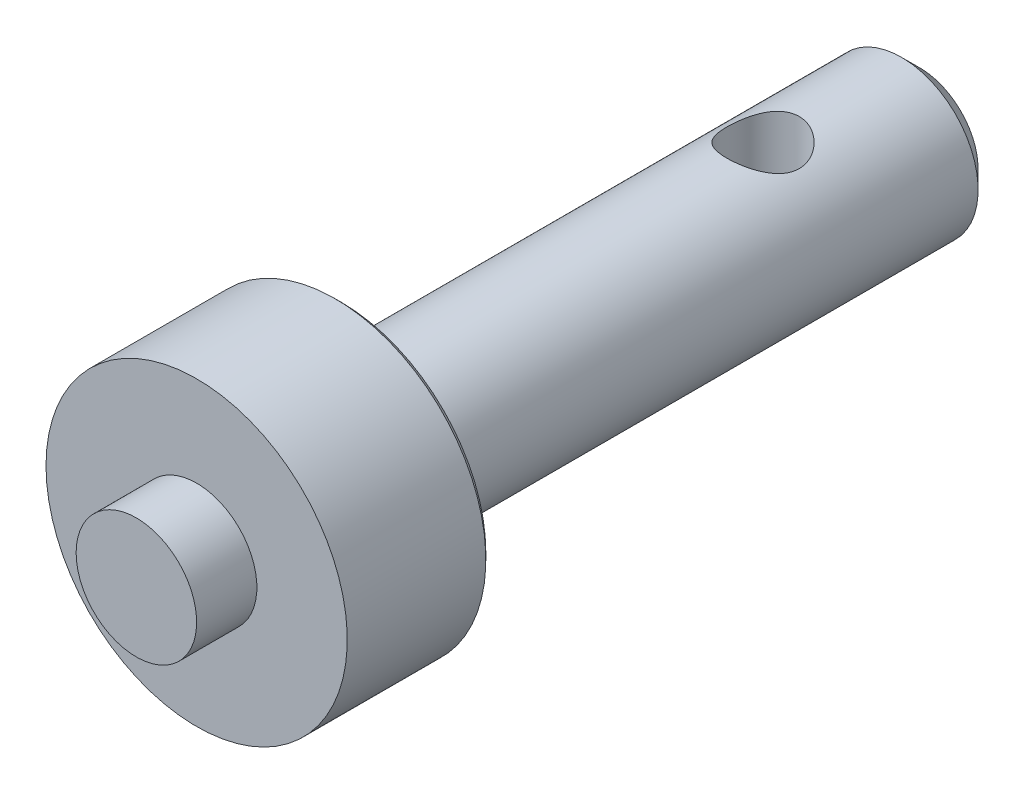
ISO-10303-21;
HEADER;
FILE_DESCRIPTION(('STEP AP214'),'2;1');
FILE_NAME('part.step','',(''),(''),'','','');
FILE_SCHEMA(('AUTOMOTIVE_DESIGN { 1 0 10303 214 1 1 1 1 }'));
ENDSEC;
DATA;
#1=APPLICATION_CONTEXT('core data for automotive mechanical design processes');
#2=APPLICATION_PROTOCOL_DEFINITION('international standard','automotive_design',2000,#1);
#3=PRODUCT_CONTEXT('',#1,'mechanical');
#4=PRODUCT('Part','Part','',(#3));
#5=PRODUCT_RELATED_PRODUCT_CATEGORY('part','',(#4));
#6=PRODUCT_DEFINITION_FORMATION('','',#4);
#7=PRODUCT_DEFINITION_CONTEXT('part definition',#1,'design');
#8=PRODUCT_DEFINITION('design','',#6,#7);
#9=PRODUCT_DEFINITION_SHAPE('','',#8);
#10=(LENGTH_UNIT() NAMED_UNIT(*) SI_UNIT(.MILLI.,.METRE.));
#11=(NAMED_UNIT(*) PLANE_ANGLE_UNIT() SI_UNIT($,.RADIAN.));
#12=(NAMED_UNIT(*) SI_UNIT($,.STERADIAN.) SOLID_ANGLE_UNIT());
#13=UNCERTAINTY_MEASURE_WITH_UNIT(LENGTH_MEASURE(1.E-05),#10,'distance_accuracy_value','');
#14=(GEOMETRIC_REPRESENTATION_CONTEXT(3) GLOBAL_UNCERTAINTY_ASSIGNED_CONTEXT((#13)) GLOBAL_UNIT_ASSIGNED_CONTEXT((#10,
#11,#12)) REPRESENTATION_CONTEXT('',''));
#15=CARTESIAN_POINT('',(0.,0.,0.));
#16=DIRECTION('',(0.,0.,1.));
#17=DIRECTION('',(1.,0.,0.));
#18=AXIS2_PLACEMENT_3D('',#15,#16,#17);
#19=CARTESIAN_POINT('',(0.,0.,0.));
#20=DIRECTION('',(0.,0.,1.));
#21=DIRECTION('',(1.,0.,0.));
#22=AXIS2_PLACEMENT_3D('',#19,#20,#21);
#23=PLANE('',#22);
#24=CARTESIAN_POINT('',(0.,0.,0.));
#25=DIRECTION('',(0.,0.,-1.));
#26=DIRECTION('',(-1.,0.,0.));
#27=AXIS2_PLACEMENT_3D('',#24,#25,#26);
#28=CIRCLE('',#27,4.99999999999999);
#29=CARTESIAN_POINT('',(-4.99999999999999,0.,0.));
#30=VERTEX_POINT('',#29);
#31=EDGE_CURVE('E10',#30,#30,#28,.T.);
#32=ORIENTED_EDGE('',*,*,#31,.F.);
#33=EDGE_LOOP('',(#32));
#34=FACE_BOUND('',#33,.T.);
#35=ADVANCED_FACE('F29',(#34),#23,.T.);
#36=CARTESIAN_POINT('',(0.,0.,-65.));
#37=DIRECTION('',(0.,0.,-1.));
#38=DIRECTION('',(-1.,0.,0.));
#39=AXIS2_PLACEMENT_3D('',#36,#37,#38);
#40=CYLINDRICAL_SURFACE('',#39,4.99999999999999);
#41=ORIENTED_EDGE('',*,*,#31,.T.);
#42=EDGE_LOOP('',(#41));
#43=FACE_BOUND('',#42,.T.);
#44=CARTESIAN_POINT('',(0.,0.,-5.));
#45=DIRECTION('',(0.,0.,-1.));
#46=DIRECTION('',(-1.,0.,0.));
#47=AXIS2_PLACEMENT_3D('',#44,#45,#46);
#48=CIRCLE('',#47,4.99999999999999);
#49=CARTESIAN_POINT('',(-4.99999999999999,0.,-5.));
#50=VERTEX_POINT('',#49);
#51=EDGE_CURVE('E40',#50,#50,#48,.T.);
#52=ORIENTED_EDGE('',*,*,#51,.F.);
#53=EDGE_LOOP('',(#52));
#54=FACE_BOUND('',#53,.T.);
#55=ADVANCED_FACE('F76',(#43,#54),#40,.T.);
#56=CARTESIAN_POINT('',(0.,4.99999999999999,-5.));
#57=DIRECTION('',(0.,0.,1.));
#58=DIRECTION('',(1.,0.,0.));
#59=AXIS2_PLACEMENT_3D('',#56,#57,#58);
#60=PLANE('',#59);
#61=ORIENTED_EDGE('',*,*,#51,.T.);
#62=EDGE_LOOP('',(#61));
#63=FACE_BOUND('',#62,.T.);
#64=CARTESIAN_POINT('',(0.,0.,-5.));
#65=DIRECTION('',(0.,0.,-1.));
#66=DIRECTION('',(-1.,0.,0.));
#67=AXIS2_PLACEMENT_3D('',#64,#65,#66);
#68=CIRCLE('',#67,12.5);
#69=CARTESIAN_POINT('',(-12.5,0.,-5.));
#70=VERTEX_POINT('',#69);
#71=EDGE_CURVE('E45',#70,#70,#68,.T.);
#72=ORIENTED_EDGE('',*,*,#71,.F.);
#73=EDGE_LOOP('',(#72));
#74=FACE_BOUND('',#73,.T.);
#75=ADVANCED_FACE('F81',(#63,#74),#60,.T.);
#76=CARTESIAN_POINT('',(0.,0.,-65.));
#77=DIRECTION('',(0.,0.,-1.));
#78=DIRECTION('',(-1.,0.,0.));
#79=AXIS2_PLACEMENT_3D('',#76,#77,#78);
#80=CYLINDRICAL_SURFACE('',#79,12.5);
#81=ORIENTED_EDGE('',*,*,#71,.T.);
#82=EDGE_LOOP('',(#81));
#83=FACE_BOUND('',#82,.T.);
#84=CARTESIAN_POINT('',(0.,0.,-16.5));
#85=DIRECTION('',(0.,0.,-1.));
#86=DIRECTION('',(-1.,0.,0.));
#87=AXIS2_PLACEMENT_3D('',#84,#85,#86);
#88=CIRCLE('',#87,12.5);
#89=CARTESIAN_POINT('',(-12.5,0.,-16.5));
#90=VERTEX_POINT('',#89);
#91=EDGE_CURVE('E110',#90,#90,#88,.T.);
#92=ORIENTED_EDGE('',*,*,#91,.F.);
#93=EDGE_LOOP('',(#92));
#94=FACE_BOUND('',#93,.T.);
#95=ADVANCED_FACE('F85',(#83,#94),#80,.T.);
#96=CARTESIAN_POINT('',(0.,0.,-17.));
#97=DIRECTION('',(0.,0.,1.));
#98=DIRECTION('',(1.,0.,0.));
#99=AXIS2_PLACEMENT_3D('',#96,#97,#98);
#100=CONICAL_SURFACE('',#99,12.,0.78539816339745);
#101=ORIENTED_EDGE('',*,*,#91,.T.);
#102=EDGE_LOOP('',(#101));
#103=FACE_BOUND('',#102,.T.);
#104=CARTESIAN_POINT('',(0.,0.,-17.));
#105=DIRECTION('',(0.,0.,-1.));
#106=DIRECTION('',(-1.,0.,0.));
#107=AXIS2_PLACEMENT_3D('',#104,#105,#106);
#108=CIRCLE('',#107,12.);
#109=CARTESIAN_POINT('',(-12.,0.,-17.));
#110=VERTEX_POINT('',#109);
#111=EDGE_CURVE('E103',#110,#110,#108,.T.);
#112=ORIENTED_EDGE('',*,*,#111,.F.);
#113=EDGE_LOOP('',(#112));
#114=FACE_BOUND('',#113,.T.);
#115=ADVANCED_FACE('F92',(#103,#114),#100,.T.);
#116=CARTESIAN_POINT('',(0.,12.,-17.));
#117=DIRECTION('',(0.,0.,-1.));
#118=DIRECTION('',(-1.,0.,0.));
#119=AXIS2_PLACEMENT_3D('',#116,#117,#118);
#120=PLANE('',#119);
#121=ORIENTED_EDGE('',*,*,#111,.T.);
#122=EDGE_LOOP('',(#121));
#123=FACE_BOUND('',#122,.T.);
#124=CARTESIAN_POINT('',(0.,0.,-17.));
#125=DIRECTION('',(0.,0.,-1.));
#126=DIRECTION('',(-1.,0.,0.));
#127=AXIS2_PLACEMENT_3D('',#124,#125,#126);
#128=CIRCLE('',#127,6.34999999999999);
#129=CARTESIAN_POINT('',(-6.34999999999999,0.,-17.));
#130=VERTEX_POINT('',#129);
#131=EDGE_CURVE('E106',#130,#130,#128,.T.);
#132=ORIENTED_EDGE('',*,*,#131,.F.);
#133=EDGE_LOOP('',(#132));
#134=FACE_BOUND('',#133,.T.);
#135=ADVANCED_FACE('F71',(#123,#134),#120,.T.);
#136=CARTESIAN_POINT('',(0.,0.,-65.));
#137=DIRECTION('',(0.,0.,-1.));
#138=DIRECTION('',(-1.,0.,0.));
#139=AXIS2_PLACEMENT_3D('',#136,#137,#138);
#140=CYLINDRICAL_SURFACE('',#139,6.34999999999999);
#141=CARTESIAN_POINT('',(0.,-6.34999999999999,-49.));
#142=CARTESIAN_POINT('',(-0.158735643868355,-6.34999131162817,-49.0000104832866));
#143=CARTESIAN_POINT('',(-0.317696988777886,-6.34398210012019,-49.0126737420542));
#144=CARTESIAN_POINT('',(-0.630982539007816,-6.32053556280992,-49.0628003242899));
#145=CARTESIAN_POINT('',(-0.785295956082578,-6.30307351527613,-49.1003172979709));
#146=CARTESIAN_POINT('',(-1.08426902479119,-6.25856360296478,-49.1983909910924));
#147=CARTESIAN_POINT('',(-1.22896239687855,-6.23155157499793,-49.2588616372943));
#148=CARTESIAN_POINT('',(-1.50596538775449,-6.17047124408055,-49.4007104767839));
#149=CARTESIAN_POINT('',(-1.63827688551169,-6.1364040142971,-49.4820854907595));
#150=CARTESIAN_POINT('',(-1.89506470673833,-6.06218401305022,-49.6686289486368));
#151=CARTESIAN_POINT('',(-2.0186935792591,-6.02179791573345,-49.7748705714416));
#152=CARTESIAN_POINT('',(-2.24713450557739,-5.94033863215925,-50.0058035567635));
#153=CARTESIAN_POINT('',(-2.35193384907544,-5.8992650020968,-50.1305072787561));
#154=CARTESIAN_POINT('',(-2.54682621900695,-5.81791039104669,-50.4050648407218));
#155=CARTESIAN_POINT('',(-2.63545600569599,-5.77786853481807,-50.5560461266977));
#156=CARTESIAN_POINT('',(-2.74809115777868,-5.72470256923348,-50.7934763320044));
#157=CARTESIAN_POINT('',(-2.78225974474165,-5.70812542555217,-50.8744765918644));
#158=CARTESIAN_POINT('',(-2.84348823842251,-5.67787297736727,-51.0396280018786));
#159=CARTESIAN_POINT('',(-2.87055214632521,-5.66419604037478,-51.1237773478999));
#160=CARTESIAN_POINT('',(-2.9159220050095,-5.6409673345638,-51.2897986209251));
#161=CARTESIAN_POINT('',(-2.93463412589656,-5.63122717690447,-51.3715334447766));
#162=CARTESIAN_POINT('',(-2.96517735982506,-5.6152044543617,-51.5365762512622));
#163=CARTESIAN_POINT('',(-2.9770119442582,-5.60892014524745,-51.6198834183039));
#164=CARTESIAN_POINT('',(-2.99363646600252,-5.60006542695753,-51.7873623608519));
#165=CARTESIAN_POINT('',(-2.99842966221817,-5.59749329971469,-51.8715337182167));
#166=CARTESIAN_POINT('',(-3.00091788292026,-5.59615798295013,-52.0399844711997));
#167=CARTESIAN_POINT('',(-2.99861346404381,-5.59739449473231,-52.1242638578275));
#168=CARTESIAN_POINT('',(-2.98228707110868,-5.60612787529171,-52.3586473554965));
#169=CARTESIAN_POINT('',(-2.96044454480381,-5.61779971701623,-52.5081386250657));
#170=CARTESIAN_POINT('',(-2.89501216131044,-5.6517888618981,-52.80091706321));
#171=CARTESIAN_POINT('',(-2.85141651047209,-5.67410900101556,-52.9442025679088));
#172=CARTESIAN_POINT('',(-2.74288007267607,-5.72737541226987,-53.2246352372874));
#173=CARTESIAN_POINT('',(-2.67746822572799,-5.75850952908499,-53.3615633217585));
#174=CARTESIAN_POINT('',(-2.5275009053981,-5.82588930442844,-53.6231136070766));
#175=CARTESIAN_POINT('',(-2.44293700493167,-5.86213721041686,-53.7477303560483));
#176=CARTESIAN_POINT('',(-2.24603652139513,-5.94055944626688,-53.9957713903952));
#177=CARTESIAN_POINT('',(-2.13165370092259,-5.98294371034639,-54.1175105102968));
#178=CARTESIAN_POINT('',(-1.88382332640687,-6.06553935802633,-54.3407340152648));
#179=CARTESIAN_POINT('',(-1.75036848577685,-6.10574990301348,-54.4422106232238));
#180=CARTESIAN_POINT('',(-1.46180089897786,-6.1813162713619,-54.6255310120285));
#181=CARTESIAN_POINT('',(-1.30606552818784,-6.21643476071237,-54.7065002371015));
#182=CARTESIAN_POINT('',(-0.981099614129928,-6.27591792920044,-54.8404697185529));
#183=CARTESIAN_POINT('',(-0.811878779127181,-6.30029026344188,-54.8934898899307));
#184=CARTESIAN_POINT('',(-0.478650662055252,-6.33397698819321,-54.9660934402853));
#185=CARTESIAN_POINT('',(-0.315236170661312,-6.34430139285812,-54.9879260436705));
#186=CARTESIAN_POINT('',(0.0132401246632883,-6.35210748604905,-55.0044690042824));
#187=CARTESIAN_POINT('',(0.178301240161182,-6.34959433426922,-54.9991902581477));
#188=CARTESIAN_POINT('',(0.493581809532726,-6.33262500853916,-54.963082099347));
#189=CARTESIAN_POINT('',(0.644051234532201,-6.31898607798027,-54.9340006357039));
#190=CARTESIAN_POINT('',(0.937719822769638,-6.28212499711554,-54.8537450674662));
#191=CARTESIAN_POINT('',(1.08091814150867,-6.25890173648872,-54.8025684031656));
#192=CARTESIAN_POINT('',(1.36096532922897,-6.20413258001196,-54.6780544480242));
#193=CARTESIAN_POINT('',(1.49748886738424,-6.17235515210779,-54.6040908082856));
#194=CARTESIAN_POINT('',(1.75666682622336,-6.103656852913,-54.4367891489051));
#195=CARTESIAN_POINT('',(1.87931512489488,-6.06673372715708,-54.3434426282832));
#196=CARTESIAN_POINT('',(2.11888943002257,-5.98749695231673,-54.1303196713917));
#197=CARTESIAN_POINT('',(2.23431643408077,-5.94499681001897,-54.0089239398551));
#198=CARTESIAN_POINT('',(2.44375164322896,-5.86202140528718,-53.7481599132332));
#199=CARTESIAN_POINT('',(2.53774887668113,-5.82154718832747,-53.6087824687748));
#200=CARTESIAN_POINT('',(2.70463547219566,-5.74596844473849,-53.3096827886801));
#201=CARTESIAN_POINT('',(2.77667149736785,-5.71110126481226,-53.1494194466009));
#202=CARTESIAN_POINT('',(2.89199593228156,-5.65359008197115,-52.8168485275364));
#203=CARTESIAN_POINT('',(2.93531709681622,-5.63093215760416,-52.6445549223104));
#204=CARTESIAN_POINT('',(2.98833110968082,-5.60296296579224,-52.3097268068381));
#205=CARTESIAN_POINT('',(3.0007349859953,-5.59625585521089,-52.1477390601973));
#206=CARTESIAN_POINT('',(2.99919821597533,-5.5970815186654,-51.8239486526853));
#207=CARTESIAN_POINT('',(2.98526553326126,-5.60460998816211,-51.6621459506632));
#208=CARTESIAN_POINT('',(2.93391097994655,-5.63164218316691,-51.3562762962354));
#209=CARTESIAN_POINT('',(2.8983673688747,-5.65018584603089,-51.2117994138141));
#210=CARTESIAN_POINT('',(2.80694513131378,-5.69615317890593,-50.9309420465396));
#211=CARTESIAN_POINT('',(2.75106038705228,-5.72357952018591,-50.7945640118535));
#212=CARTESIAN_POINT('',(2.61632375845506,-5.78646860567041,-50.5237790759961));
#213=CARTESIAN_POINT('',(2.53618984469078,-5.8223450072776,-50.3901087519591));
#214=CARTESIAN_POINT('',(2.35675969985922,-5.89725587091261,-50.1372777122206));
#215=CARTESIAN_POINT('',(2.25745430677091,-5.93629183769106,-50.0181239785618));
#216=CARTESIAN_POINT('',(2.0303859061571,-6.01797799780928,-49.7848906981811));
#217=CARTESIAN_POINT('',(1.90073846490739,-6.06058247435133,-49.6726235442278));
#218=CARTESIAN_POINT('',(1.62298549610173,-6.14078504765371,-49.471105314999));
#219=CARTESIAN_POINT('',(1.47487109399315,-6.17838071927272,-49.3818653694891));
#220=CARTESIAN_POINT('',(1.24202481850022,-6.22785646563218,-49.2678129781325));
#221=CARTESIAN_POINT('',(1.16272476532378,-6.24318215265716,-49.2331244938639));
#222=CARTESIAN_POINT('',(1.00102034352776,-6.27113792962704,-49.1706082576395));
#223=CARTESIAN_POINT('',(0.918617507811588,-6.28376933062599,-49.1427771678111));
#224=CARTESIAN_POINT('',(0.751519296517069,-6.30593452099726,-49.0943552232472));
#225=CARTESIAN_POINT('',(0.666829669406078,-6.31547541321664,-49.073747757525));
#226=CARTESIAN_POINT('',(0.495718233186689,-6.33120329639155,-49.0399560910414));
#227=CARTESIAN_POINT('',(0.409297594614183,-6.33739247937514,-49.0267670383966));
#228=CARTESIAN_POINT('',(0.26890998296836,-6.34452974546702,-49.0115919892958));
#229=CARTESIAN_POINT('',(0.215242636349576,-6.34657804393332,-49.0072482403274));
#230=CARTESIAN_POINT('',(0.107725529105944,-6.34931466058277,-49.0014504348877));
#231=CARTESIAN_POINT('',(0.0538757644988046,-6.35000294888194,-48.9999964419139));
#232=CARTESIAN_POINT('',(0.,-6.34999999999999,-49.));
#233=B_SPLINE_CURVE_WITH_KNOTS('',3,(#141,#142,#143,#144,#145,#146,#147,#148,#149,#150,#151,
#152,#153,#154,#155,#156,#157,#158,#159,#160,#161,#162,#163,#164,#165,#166,#167,#168,#169,#170,
#171,#172,#173,#174,#175,#176,#177,#178,#179,#180,#181,#182,#183,#184,#185,#186,#187,#188,#189,
#190,#191,#192,#193,#194,#195,#196,#197,#198,#199,#200,#201,#202,#203,#204,#205,#206,#207,#208,
#209,#210,#211,#212,#213,#214,#215,#216,#217,#218,#219,#220,#221,#222,#223,#224,#225,#226,#227,
#228,#229,#230,#231,#232),.UNSPECIFIED.,.T.,.F.,(4,2,2,2,2,2,2,2,2,2,2,2,2,2,2,2,2,2,2,2,2,2,2,
2,2,2,2,2,2,2,2,2,2,2,2,2,2,2,2,2,2,2,2,2,2,4),(0.,0.475997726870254,0.953026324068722,
1.42828352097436,1.90346847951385,2.405132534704,2.90713396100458,3.44289983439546,
3.71097177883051,3.97889242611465,4.23178157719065,4.48454297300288,4.7371873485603,
4.98981191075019,5.44206841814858,5.89444544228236,6.35730164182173,6.82036189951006,
7.33510031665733,7.85003592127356,8.38419883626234,8.91798061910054,9.41089442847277,
9.9036101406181,10.3630820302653,10.8226071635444,11.2961009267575,11.7698027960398,
12.2859764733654,12.8024138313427,13.3369155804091,13.8708065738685,14.3559144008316,
14.8408755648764,15.2887410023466,15.7367412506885,16.2145869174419,16.6926615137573,
17.2203903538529,17.7483737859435,18.0117778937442,18.275053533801,18.5377197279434,
18.8002139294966,18.9617666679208,19.1233229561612),.UNSPECIFIED.);
#234=CARTESIAN_POINT('',(0.,-6.34999999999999,-49.));
#235=VERTEX_POINT('',#234);
#236=EDGE_CURVE('E32',#235,#235,#233,.T.);
#237=ORIENTED_EDGE('',*,*,#236,.F.);
#238=EDGE_LOOP('',(#237));
#239=FACE_BOUND('',#238,.T.);
#240=CARTESIAN_POINT('',(0.,6.34999999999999,-49.));
#241=CARTESIAN_POINT('',(0.158735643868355,6.34999131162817,-49.0000104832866));
#242=CARTESIAN_POINT('',(0.317696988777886,6.34398210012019,-49.0126737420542));
#243=CARTESIAN_POINT('',(0.630982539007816,6.32053556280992,-49.0628003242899));
#244=CARTESIAN_POINT('',(0.785295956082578,6.30307351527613,-49.1003172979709));
#245=CARTESIAN_POINT('',(1.08426902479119,6.25856360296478,-49.1983909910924));
#246=CARTESIAN_POINT('',(1.22896239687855,6.23155157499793,-49.2588616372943));
#247=CARTESIAN_POINT('',(1.50596538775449,6.17047124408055,-49.4007104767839));
#248=CARTESIAN_POINT('',(1.63827688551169,6.1364040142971,-49.4820854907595));
#249=CARTESIAN_POINT('',(1.89506470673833,6.06218401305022,-49.6686289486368));
#250=CARTESIAN_POINT('',(2.0186935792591,6.02179791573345,-49.7748705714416));
#251=CARTESIAN_POINT('',(2.24713450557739,5.94033863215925,-50.0058035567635));
#252=CARTESIAN_POINT('',(2.35193384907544,5.8992650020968,-50.1305072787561));
#253=CARTESIAN_POINT('',(2.54682621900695,5.81791039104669,-50.4050648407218));
#254=CARTESIAN_POINT('',(2.63545600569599,5.77786853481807,-50.5560461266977));
#255=CARTESIAN_POINT('',(2.74809115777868,5.72470256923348,-50.7934763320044));
#256=CARTESIAN_POINT('',(2.78225974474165,5.70812542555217,-50.8744765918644));
#257=CARTESIAN_POINT('',(2.84348823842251,5.67787297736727,-51.0396280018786));
#258=CARTESIAN_POINT('',(2.87055214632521,5.66419604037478,-51.1237773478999));
#259=CARTESIAN_POINT('',(2.9159220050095,5.6409673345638,-51.2897986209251));
#260=CARTESIAN_POINT('',(2.93463412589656,5.63122717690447,-51.3715334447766));
#261=CARTESIAN_POINT('',(2.96517735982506,5.6152044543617,-51.5365762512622));
#262=CARTESIAN_POINT('',(2.9770119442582,5.60892014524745,-51.6198834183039));
#263=CARTESIAN_POINT('',(2.99363646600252,5.60006542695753,-51.7873623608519));
#264=CARTESIAN_POINT('',(2.99842966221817,5.59749329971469,-51.8715337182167));
#265=CARTESIAN_POINT('',(3.00091788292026,5.59615798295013,-52.0399844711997));
#266=CARTESIAN_POINT('',(2.99861346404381,5.59739449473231,-52.1242638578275));
#267=CARTESIAN_POINT('',(2.98228707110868,5.60612787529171,-52.3586473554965));
#268=CARTESIAN_POINT('',(2.96044454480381,5.61779971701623,-52.5081386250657));
#269=CARTESIAN_POINT('',(2.89501216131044,5.6517888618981,-52.80091706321));
#270=CARTESIAN_POINT('',(2.85141651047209,5.67410900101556,-52.9442025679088));
#271=CARTESIAN_POINT('',(2.74288007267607,5.72737541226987,-53.2246352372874));
#272=CARTESIAN_POINT('',(2.67746822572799,5.75850952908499,-53.3615633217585));
#273=CARTESIAN_POINT('',(2.5275009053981,5.82588930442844,-53.6231136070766));
#274=CARTESIAN_POINT('',(2.44293700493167,5.86213721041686,-53.7477303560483));
#275=CARTESIAN_POINT('',(2.24603652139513,5.94055944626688,-53.9957713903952));
#276=CARTESIAN_POINT('',(2.13165370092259,5.98294371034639,-54.1175105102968));
#277=CARTESIAN_POINT('',(1.88382332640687,6.06553935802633,-54.3407340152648));
#278=CARTESIAN_POINT('',(1.75036848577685,6.10574990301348,-54.4422106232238));
#279=CARTESIAN_POINT('',(1.46180089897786,6.1813162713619,-54.6255310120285));
#280=CARTESIAN_POINT('',(1.30606552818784,6.21643476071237,-54.7065002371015));
#281=CARTESIAN_POINT('',(0.981099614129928,6.27591792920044,-54.8404697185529));
#282=CARTESIAN_POINT('',(0.811878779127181,6.30029026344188,-54.8934898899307));
#283=CARTESIAN_POINT('',(0.478650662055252,6.33397698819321,-54.9660934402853));
#284=CARTESIAN_POINT('',(0.315236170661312,6.34430139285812,-54.9879260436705));
#285=CARTESIAN_POINT('',(-0.0132401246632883,6.35210748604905,-55.0044690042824));
#286=CARTESIAN_POINT('',(-0.178301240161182,6.34959433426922,-54.9991902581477));
#287=CARTESIAN_POINT('',(-0.493581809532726,6.33262500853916,-54.963082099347));
#288=CARTESIAN_POINT('',(-0.644051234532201,6.31898607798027,-54.9340006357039));
#289=CARTESIAN_POINT('',(-0.937719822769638,6.28212499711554,-54.8537450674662));
#290=CARTESIAN_POINT('',(-1.08091814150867,6.25890173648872,-54.8025684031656));
#291=CARTESIAN_POINT('',(-1.36096532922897,6.20413258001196,-54.6780544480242));
#292=CARTESIAN_POINT('',(-1.49748886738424,6.17235515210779,-54.6040908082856));
#293=CARTESIAN_POINT('',(-1.75666682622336,6.103656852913,-54.4367891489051));
#294=CARTESIAN_POINT('',(-1.87931512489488,6.06673372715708,-54.3434426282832));
#295=CARTESIAN_POINT('',(-2.11888943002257,5.98749695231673,-54.1303196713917));
#296=CARTESIAN_POINT('',(-2.23431643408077,5.94499681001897,-54.0089239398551));
#297=CARTESIAN_POINT('',(-2.44375164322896,5.86202140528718,-53.7481599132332));
#298=CARTESIAN_POINT('',(-2.53774887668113,5.82154718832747,-53.6087824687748));
#299=CARTESIAN_POINT('',(-2.70463547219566,5.74596844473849,-53.3096827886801));
#300=CARTESIAN_POINT('',(-2.77667149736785,5.71110126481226,-53.1494194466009));
#301=CARTESIAN_POINT('',(-2.89199593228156,5.65359008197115,-52.8168485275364));
#302=CARTESIAN_POINT('',(-2.93531709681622,5.63093215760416,-52.6445549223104));
#303=CARTESIAN_POINT('',(-2.98833110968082,5.60296296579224,-52.3097268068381));
#304=CARTESIAN_POINT('',(-3.0007349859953,5.59625585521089,-52.1477390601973));
#305=CARTESIAN_POINT('',(-2.99919821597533,5.5970815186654,-51.8239486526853));
#306=CARTESIAN_POINT('',(-2.98526553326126,5.60460998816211,-51.6621459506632));
#307=CARTESIAN_POINT('',(-2.93391097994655,5.63164218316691,-51.3562762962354));
#308=CARTESIAN_POINT('',(-2.8983673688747,5.65018584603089,-51.2117994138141));
#309=CARTESIAN_POINT('',(-2.80694513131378,5.69615317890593,-50.9309420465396));
#310=CARTESIAN_POINT('',(-2.75106038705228,5.72357952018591,-50.7945640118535));
#311=CARTESIAN_POINT('',(-2.61632375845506,5.78646860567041,-50.5237790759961));
#312=CARTESIAN_POINT('',(-2.53618984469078,5.8223450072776,-50.3901087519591));
#313=CARTESIAN_POINT('',(-2.35675969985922,5.89725587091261,-50.1372777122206));
#314=CARTESIAN_POINT('',(-2.25745430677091,5.93629183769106,-50.0181239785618));
#315=CARTESIAN_POINT('',(-2.0303859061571,6.01797799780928,-49.7848906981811));
#316=CARTESIAN_POINT('',(-1.90073846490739,6.06058247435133,-49.6726235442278));
#317=CARTESIAN_POINT('',(-1.62298549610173,6.14078504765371,-49.471105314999));
#318=CARTESIAN_POINT('',(-1.47487109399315,6.17838071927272,-49.3818653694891));
#319=CARTESIAN_POINT('',(-1.24202481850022,6.22785646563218,-49.2678129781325));
#320=CARTESIAN_POINT('',(-1.16272476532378,6.24318215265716,-49.2331244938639));
#321=CARTESIAN_POINT('',(-1.00102034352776,6.27113792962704,-49.1706082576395));
#322=CARTESIAN_POINT('',(-0.918617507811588,6.28376933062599,-49.1427771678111));
#323=CARTESIAN_POINT('',(-0.751519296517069,6.30593452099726,-49.0943552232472));
#324=CARTESIAN_POINT('',(-0.666829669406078,6.31547541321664,-49.073747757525));
#325=CARTESIAN_POINT('',(-0.495718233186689,6.33120329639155,-49.0399560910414));
#326=CARTESIAN_POINT('',(-0.409297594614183,6.33739247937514,-49.0267670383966));
#327=CARTESIAN_POINT('',(-0.26890998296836,6.34452974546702,-49.0115919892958));
#328=CARTESIAN_POINT('',(-0.215242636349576,6.34657804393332,-49.0072482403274));
#329=CARTESIAN_POINT('',(-0.107725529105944,6.34931466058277,-49.0014504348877));
#330=CARTESIAN_POINT('',(-0.0538757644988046,6.35000294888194,-48.9999964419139));
#331=CARTESIAN_POINT('',(0.,6.34999999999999,-49.));
#332=B_SPLINE_CURVE_WITH_KNOTS('',3,(#240,#241,#242,#243,#244,#245,#246,#247,#248,#249,#250,
#251,#252,#253,#254,#255,#256,#257,#258,#259,#260,#261,#262,#263,#264,#265,#266,#267,#268,#269,
#270,#271,#272,#273,#274,#275,#276,#277,#278,#279,#280,#281,#282,#283,#284,#285,#286,#287,#288,
#289,#290,#291,#292,#293,#294,#295,#296,#297,#298,#299,#300,#301,#302,#303,#304,#305,#306,#307,
#308,#309,#310,#311,#312,#313,#314,#315,#316,#317,#318,#319,#320,#321,#322,#323,#324,#325,#326,
#327,#328,#329,#330,#331),.UNSPECIFIED.,.T.,.F.,(4,2,2,2,2,2,2,2,2,2,2,2,2,2,2,2,2,2,2,2,2,2,2,
2,2,2,2,2,2,2,2,2,2,2,2,2,2,2,2,2,2,2,2,2,2,4),(0.,0.475997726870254,0.953026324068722,
1.42828352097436,1.90346847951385,2.405132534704,2.90713396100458,3.44289983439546,
3.71097177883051,3.97889242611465,4.23178157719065,4.48454297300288,4.7371873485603,
4.98981191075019,5.44206841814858,5.89444544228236,6.35730164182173,6.82036189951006,
7.33510031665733,7.85003592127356,8.38419883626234,8.91798061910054,9.41089442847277,
9.9036101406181,10.3630820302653,10.8226071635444,11.2961009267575,11.7698027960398,
12.2859764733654,12.8024138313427,13.3369155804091,13.8708065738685,14.3559144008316,
14.8408755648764,15.2887410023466,15.7367412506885,16.2145869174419,16.6926615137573,
17.2203903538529,17.7483737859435,18.0117778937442,18.275053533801,18.5377197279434,
18.8002139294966,18.9617666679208,19.1233229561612),.UNSPECIFIED.);
#333=CARTESIAN_POINT('',(0.,6.34999999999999,-49.));
#334=VERTEX_POINT('',#333);
#335=EDGE_CURVE('E48',#334,#334,#332,.T.);
#336=ORIENTED_EDGE('',*,*,#335,.F.);
#337=EDGE_LOOP('',(#336));
#338=FACE_BOUND('',#337,.T.);
#339=ORIENTED_EDGE('',*,*,#131,.T.);
#340=EDGE_LOOP('',(#339));
#341=FACE_BOUND('',#340,.T.);
#342=CARTESIAN_POINT('',(0.,0.,-63.5));
#343=DIRECTION('',(0.,0.,-1.));
#344=DIRECTION('',(-1.,0.,0.));
#345=AXIS2_PLACEMENT_3D('',#342,#343,#344);
#346=CIRCLE('',#345,6.34999999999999);
#347=CARTESIAN_POINT('',(-6.34999999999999,0.,-63.5));
#348=VERTEX_POINT('',#347);
#349=EDGE_CURVE('E108',#348,#348,#346,.T.);
#350=ORIENTED_EDGE('',*,*,#349,.F.);
#351=EDGE_LOOP('',(#350));
#352=FACE_BOUND('',#351,.T.);
#353=ADVANCED_FACE('F52',(#239,#338,#341,#352),#140,.T.);
#354=CARTESIAN_POINT('',(0.,0.,-65.));
#355=DIRECTION('',(0.,0.,1.));
#356=DIRECTION('',(1.,0.,0.));
#357=AXIS2_PLACEMENT_3D('',#354,#355,#356);
#358=CONICAL_SURFACE('',#357,4.84999999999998,0.785398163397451);
#359=ORIENTED_EDGE('',*,*,#349,.T.);
#360=EDGE_LOOP('',(#359));
#361=FACE_BOUND('',#360,.T.);
#362=CARTESIAN_POINT('',(0.,0.,-65.));
#363=DIRECTION('',(0.,0.,-1.));
#364=DIRECTION('',(-1.,0.,0.));
#365=AXIS2_PLACEMENT_3D('',#362,#363,#364);
#366=CIRCLE('',#365,4.84999999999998);
#367=CARTESIAN_POINT('',(-4.84999999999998,0.,-65.));
#368=VERTEX_POINT('',#367);
#369=EDGE_CURVE('E112',#368,#368,#366,.T.);
#370=ORIENTED_EDGE('',*,*,#369,.F.);
#371=EDGE_LOOP('',(#370));
#372=FACE_BOUND('',#371,.T.);
#373=ADVANCED_FACE('F64',(#361,#372),#358,.T.);
#374=CARTESIAN_POINT('',(0.,4.84999999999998,-65.));
#375=DIRECTION('',(0.,0.,-1.));
#376=DIRECTION('',(-1.,0.,0.));
#377=AXIS2_PLACEMENT_3D('',#374,#375,#376);
#378=PLANE('',#377);
#379=ORIENTED_EDGE('',*,*,#369,.T.);
#380=EDGE_LOOP('',(#379));
#381=FACE_BOUND('',#380,.T.);
#382=ADVANCED_FACE('F60',(#381),#378,.T.);
#383=CARTESIAN_POINT('',(0.,-10.,-52.));
#384=DIRECTION('',(0.,1.,0.));
#385=DIRECTION('',(0.,0.,1.));
#386=AXIS2_PLACEMENT_3D('',#383,#384,#385);
#387=CYLINDRICAL_SURFACE('',#386,3.);
#388=ORIENTED_EDGE('',*,*,#236,.T.);
#389=EDGE_LOOP('',(#388));
#390=FACE_BOUND('',#389,.T.);
#391=ORIENTED_EDGE('',*,*,#335,.T.);
#392=EDGE_LOOP('',(#391));
#393=FACE_BOUND('',#392,.T.);
#394=ADVANCED_FACE('F56',(#390,#393),#387,.F.);
#395=CLOSED_SHELL('',(#35,#55,#75,#95,#115,#135,#353,#373,#382,#394));
#396=MANIFOLD_SOLID_BREP('B2',#395);
#397=ADVANCED_BREP_SHAPE_REPRESENTATION('',(#18,#396),#14);
#398=SHAPE_DEFINITION_REPRESENTATION(#9,#397);
ENDSEC;
END-ISO-10303-21;
